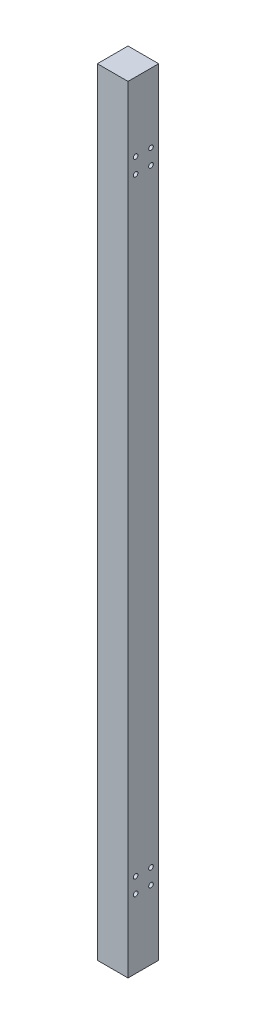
ISO-10303-21;
HEADER;
FILE_DESCRIPTION(('STEP AP214'),'2;1');
FILE_NAME('part.step','',(''),(''),'','','');
FILE_SCHEMA(('AUTOMOTIVE_DESIGN { 1 0 10303 214 1 1 1 1 }'));
ENDSEC;
DATA;
#1=APPLICATION_CONTEXT('core data for automotive mechanical design processes');
#2=APPLICATION_PROTOCOL_DEFINITION('international standard','automotive_design',2000,#1);
#3=PRODUCT_CONTEXT('',#1,'mechanical');
#4=PRODUCT('Part','Part','',(#3));
#5=PRODUCT_RELATED_PRODUCT_CATEGORY('part','',(#4));
#6=PRODUCT_DEFINITION_FORMATION('','',#4);
#7=PRODUCT_DEFINITION_CONTEXT('part definition',#1,'design');
#8=PRODUCT_DEFINITION('design','',#6,#7);
#9=PRODUCT_DEFINITION_SHAPE('','',#8);
#10=(LENGTH_UNIT() NAMED_UNIT(*) SI_UNIT(.MILLI.,.METRE.));
#11=(NAMED_UNIT(*) PLANE_ANGLE_UNIT() SI_UNIT($,.RADIAN.));
#12=(NAMED_UNIT(*) SI_UNIT($,.STERADIAN.) SOLID_ANGLE_UNIT());
#13=UNCERTAINTY_MEASURE_WITH_UNIT(LENGTH_MEASURE(1.E-05),#10,'distance_accuracy_value','');
#14=(GEOMETRIC_REPRESENTATION_CONTEXT(3) GLOBAL_UNCERTAINTY_ASSIGNED_CONTEXT((#13)) GLOBAL_UNIT_ASSIGNED_CONTEXT((#10,
#11,#12)) REPRESENTATION_CONTEXT('',''));
#15=CARTESIAN_POINT('',(0.,0.,0.));
#16=DIRECTION('',(0.,0.,1.));
#17=DIRECTION('',(1.,0.,0.));
#18=AXIS2_PLACEMENT_3D('',#15,#16,#17);
#19=CARTESIAN_POINT('',(-30.,1520.,-30.));
#20=DIRECTION('',(1.,0.,0.));
#21=DIRECTION('',(0.,0.,-1.));
#22=AXIS2_PLACEMENT_3D('',#19,#20,#21);
#23=PLANE('',#22);
#24=CARTESIAN_POINT('',(-30.,165.,15.0000000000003));
#25=DIRECTION('',(-1.,0.,0.));
#26=DIRECTION('',(0.,0.,1.));
#27=AXIS2_PLACEMENT_3D('',#24,#25,#26);
#28=CIRCLE('',#27,9.00000000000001);
#29=CARTESIAN_POINT('',(-30.,165.,24.0000000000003));
#30=VERTEX_POINT('',#29);
#31=EDGE_CURVE('E201',#30,#30,#28,.T.);
#32=ORIENTED_EDGE('',*,*,#31,.F.);
#33=EDGE_LOOP('',(#32));
#34=FACE_BOUND('',#33,.T.);
#35=CARTESIAN_POINT('',(-30.,135.,15.0000000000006));
#36=DIRECTION('',(-1.,0.,0.));
#37=DIRECTION('',(0.,0.,1.));
#38=AXIS2_PLACEMENT_3D('',#35,#36,#37);
#39=CIRCLE('',#38,9.00000000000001);
#40=CARTESIAN_POINT('',(-30.,135.,24.0000000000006));
#41=VERTEX_POINT('',#40);
#42=EDGE_CURVE('E189',#41,#41,#39,.T.);
#43=ORIENTED_EDGE('',*,*,#42,.F.);
#44=EDGE_LOOP('',(#43));
#45=FACE_BOUND('',#44,.T.);
#46=CARTESIAN_POINT('',(-30.,1385.,-15.));
#47=DIRECTION('',(-1.,0.,0.));
#48=DIRECTION('',(0.,0.,1.));
#49=AXIS2_PLACEMENT_3D('',#46,#47,#48);
#50=CIRCLE('',#49,8.9999999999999);
#51=CARTESIAN_POINT('',(-30.,1385.,-6.0000000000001));
#52=VERTEX_POINT('',#51);
#53=EDGE_CURVE('E177',#52,#52,#50,.T.);
#54=ORIENTED_EDGE('',*,*,#53,.F.);
#55=EDGE_LOOP('',(#54));
#56=FACE_BOUND('',#55,.T.);
#57=CARTESIAN_POINT('',(-30.,1385.,15.));
#58=DIRECTION('',(-1.,0.,0.));
#59=DIRECTION('',(0.,0.,1.));
#60=AXIS2_PLACEMENT_3D('',#57,#58,#59);
#61=CIRCLE('',#60,8.9999999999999);
#62=CARTESIAN_POINT('',(-30.,1385.,23.9999999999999));
#63=VERTEX_POINT('',#62);
#64=EDGE_CURVE('E165',#63,#63,#61,.T.);
#65=ORIENTED_EDGE('',*,*,#64,.F.);
#66=EDGE_LOOP('',(#65));
#67=FACE_BOUND('',#66,.T.);
#68=CARTESIAN_POINT('',(-30.,1355.,15.0000000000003));
#69=DIRECTION('',(-1.,0.,0.));
#70=DIRECTION('',(0.,0.,1.));
#71=AXIS2_PLACEMENT_3D('',#68,#69,#70);
#72=CIRCLE('',#71,8.9999999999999);
#73=CARTESIAN_POINT('',(-30.,1355.,24.0000000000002));
#74=VERTEX_POINT('',#73);
#75=EDGE_CURVE('E153',#74,#74,#72,.T.);
#76=ORIENTED_EDGE('',*,*,#75,.F.);
#77=EDGE_LOOP('',(#76));
#78=FACE_BOUND('',#77,.T.);
#79=DIRECTION('',(0.,0.,1.));
#80=VECTOR('',#79,1.);
#81=CARTESIAN_POINT('',(-30.,0.,-30.));
#82=LINE('',#81,#80);
#83=CARTESIAN_POINT('',(-30.,0.,-30.));
#84=VERTEX_POINT('',#83);
#85=CARTESIAN_POINT('',(-30.,0.,30.));
#86=VERTEX_POINT('',#85);
#87=EDGE_CURVE('E89',#84,#86,#82,.T.);
#88=ORIENTED_EDGE('',*,*,#87,.T.);
#89=DIRECTION('',(0.,-1.,0.));
#90=VECTOR('',#89,1.);
#91=CARTESIAN_POINT('',(-30.,1520.,30.));
#92=LINE('',#91,#90);
#93=CARTESIAN_POINT('',(-30.,1520.,30.));
#94=VERTEX_POINT('',#93);
#95=EDGE_CURVE('E112',#94,#86,#92,.T.);
#96=ORIENTED_EDGE('',*,*,#95,.F.);
#97=DIRECTION('',(0.,0.,1.));
#98=VECTOR('',#97,1.);
#99=CARTESIAN_POINT('',(-30.,1520.,-30.));
#100=LINE('',#99,#98);
#101=CARTESIAN_POINT('',(-30.,1520.,-30.));
#102=VERTEX_POINT('',#101);
#103=EDGE_CURVE('E105',#102,#94,#100,.T.);
#104=ORIENTED_EDGE('',*,*,#103,.F.);
#105=DIRECTION('',(0.,-1.,0.));
#106=VECTOR('',#105,1.);
#107=CARTESIAN_POINT('',(-30.,1520.,-30.));
#108=LINE('',#107,#106);
#109=EDGE_CURVE('E64',#102,#84,#108,.T.);
#110=ORIENTED_EDGE('',*,*,#109,.T.);
#111=EDGE_LOOP('',(#88,#96,#104,#110));
#112=FACE_BOUND('',#111,.T.);
#113=CARTESIAN_POINT('',(-30.,1355.,-14.9999999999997));
#114=DIRECTION('',(-1.,0.,0.));
#115=DIRECTION('',(0.,0.,1.));
#116=AXIS2_PLACEMENT_3D('',#113,#114,#115);
#117=CIRCLE('',#116,8.9999999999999);
#118=CARTESIAN_POINT('',(-30.,1355.,-5.99999999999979));
#119=VERTEX_POINT('',#118);
#120=EDGE_CURVE('E141',#119,#119,#117,.T.);
#121=ORIENTED_EDGE('',*,*,#120,.F.);
#122=EDGE_LOOP('',(#121));
#123=FACE_BOUND('',#122,.T.);
#124=CARTESIAN_POINT('',(-30.,165.,-14.9999999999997));
#125=DIRECTION('',(-1.,0.,0.));
#126=DIRECTION('',(0.,0.,1.));
#127=AXIS2_PLACEMENT_3D('',#124,#125,#126);
#128=CIRCLE('',#127,9.00000000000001);
#129=CARTESIAN_POINT('',(-30.,165.,-5.99999999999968));
#130=VERTEX_POINT('',#129);
#131=EDGE_CURVE('E213',#130,#130,#128,.T.);
#132=ORIENTED_EDGE('',*,*,#131,.F.);
#133=EDGE_LOOP('',(#132));
#134=FACE_BOUND('',#133,.T.);
#135=CARTESIAN_POINT('',(-30.,135.,-14.9999999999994));
#136=DIRECTION('',(-1.,0.,0.));
#137=DIRECTION('',(0.,0.,1.));
#138=AXIS2_PLACEMENT_3D('',#135,#136,#137);
#139=CIRCLE('',#138,9.00000000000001);
#140=CARTESIAN_POINT('',(-30.,135.,-5.99999999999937));
#141=VERTEX_POINT('',#140);
#142=EDGE_CURVE('E225',#141,#141,#139,.T.);
#143=ORIENTED_EDGE('',*,*,#142,.F.);
#144=EDGE_LOOP('',(#143));
#145=FACE_BOUND('',#144,.T.);
#146=ADVANCED_FACE('F55',(#34,#45,#56,#67,#78,#112,#123,#134,#145),#23,.F.);
#147=CARTESIAN_POINT('',(30.,1520.,-30.));
#148=DIRECTION('',(-1.,0.,0.));
#149=DIRECTION('',(0.,0.,1.));
#150=AXIS2_PLACEMENT_3D('',#147,#148,#149);
#151=PLANE('',#150);
#152=CARTESIAN_POINT('',(30.,135.,-14.9999999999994));
#153=DIRECTION('',(-1.,0.,0.));
#154=DIRECTION('',(0.,0.,1.));
#155=AXIS2_PLACEMENT_3D('',#152,#153,#154);
#156=CIRCLE('',#155,4.49999999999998);
#157=CARTESIAN_POINT('',(30.,135.,-10.4999999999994));
#158=VERTEX_POINT('',#157);
#159=EDGE_CURVE('E216',#158,#158,#156,.T.);
#160=ORIENTED_EDGE('',*,*,#159,.T.);
#161=EDGE_LOOP('',(#160));
#162=FACE_BOUND('',#161,.T.);
#163=CARTESIAN_POINT('',(30.,165.,-14.9999999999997));
#164=DIRECTION('',(-1.,0.,0.));
#165=DIRECTION('',(0.,0.,1.));
#166=AXIS2_PLACEMENT_3D('',#163,#164,#165);
#167=CIRCLE('',#166,4.49999999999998);
#168=CARTESIAN_POINT('',(30.,165.,-10.4999999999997));
#169=VERTEX_POINT('',#168);
#170=EDGE_CURVE('E204',#169,#169,#167,.T.);
#171=ORIENTED_EDGE('',*,*,#170,.T.);
#172=EDGE_LOOP('',(#171));
#173=FACE_BOUND('',#172,.T.);
#174=CARTESIAN_POINT('',(30.,165.,15.0000000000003));
#175=DIRECTION('',(-1.,0.,0.));
#176=DIRECTION('',(0.,0.,1.));
#177=AXIS2_PLACEMENT_3D('',#174,#175,#176);
#178=CIRCLE('',#177,4.49999999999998);
#179=CARTESIAN_POINT('',(30.,165.,19.5000000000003));
#180=VERTEX_POINT('',#179);
#181=EDGE_CURVE('E192',#180,#180,#178,.T.);
#182=ORIENTED_EDGE('',*,*,#181,.T.);
#183=EDGE_LOOP('',(#182));
#184=FACE_BOUND('',#183,.T.);
#185=CARTESIAN_POINT('',(30.,135.,15.0000000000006));
#186=DIRECTION('',(-1.,0.,0.));
#187=DIRECTION('',(0.,0.,1.));
#188=AXIS2_PLACEMENT_3D('',#185,#186,#187);
#189=CIRCLE('',#188,4.49999999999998);
#190=CARTESIAN_POINT('',(30.,135.,19.5000000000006));
#191=VERTEX_POINT('',#190);
#192=EDGE_CURVE('E180',#191,#191,#189,.T.);
#193=ORIENTED_EDGE('',*,*,#192,.T.);
#194=EDGE_LOOP('',(#193));
#195=FACE_BOUND('',#194,.T.);
#196=CARTESIAN_POINT('',(30.,1385.,-15.));
#197=DIRECTION('',(-1.,0.,0.));
#198=DIRECTION('',(0.,0.,1.));
#199=AXIS2_PLACEMENT_3D('',#196,#197,#198);
#200=CIRCLE('',#199,4.49999999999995);
#201=CARTESIAN_POINT('',(30.,1385.,-10.5000000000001));
#202=VERTEX_POINT('',#201);
#203=EDGE_CURVE('E168',#202,#202,#200,.T.);
#204=ORIENTED_EDGE('',*,*,#203,.T.);
#205=EDGE_LOOP('',(#204));
#206=FACE_BOUND('',#205,.T.);
#207=CARTESIAN_POINT('',(30.,1385.,15.));
#208=DIRECTION('',(-1.,0.,0.));
#209=DIRECTION('',(0.,0.,1.));
#210=AXIS2_PLACEMENT_3D('',#207,#208,#209);
#211=CIRCLE('',#210,4.49999999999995);
#212=CARTESIAN_POINT('',(30.,1385.,19.4999999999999));
#213=VERTEX_POINT('',#212);
#214=EDGE_CURVE('E156',#213,#213,#211,.T.);
#215=ORIENTED_EDGE('',*,*,#214,.T.);
#216=EDGE_LOOP('',(#215));
#217=FACE_BOUND('',#216,.T.);
#218=CARTESIAN_POINT('',(30.,1355.,15.0000000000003));
#219=DIRECTION('',(-1.,0.,0.));
#220=DIRECTION('',(0.,0.,1.));
#221=AXIS2_PLACEMENT_3D('',#218,#219,#220);
#222=CIRCLE('',#221,4.49999999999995);
#223=CARTESIAN_POINT('',(30.,1355.,19.5000000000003));
#224=VERTEX_POINT('',#223);
#225=EDGE_CURVE('E144',#224,#224,#222,.T.);
#226=ORIENTED_EDGE('',*,*,#225,.T.);
#227=EDGE_LOOP('',(#226));
#228=FACE_BOUND('',#227,.T.);
#229=CARTESIAN_POINT('',(30.,1355.,-14.9999999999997));
#230=DIRECTION('',(-1.,0.,0.));
#231=DIRECTION('',(0.,0.,1.));
#232=AXIS2_PLACEMENT_3D('',#229,#230,#231);
#233=CIRCLE('',#232,4.49999999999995);
#234=CARTESIAN_POINT('',(30.,1355.,-10.4999999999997));
#235=VERTEX_POINT('',#234);
#236=EDGE_CURVE('E122',#235,#235,#233,.T.);
#237=ORIENTED_EDGE('',*,*,#236,.T.);
#238=EDGE_LOOP('',(#237));
#239=FACE_BOUND('',#238,.T.);
#240=DIRECTION('',(0.,0.,-1.));
#241=VECTOR('',#240,1.);
#242=CARTESIAN_POINT('',(30.,0.,-30.));
#243=LINE('',#242,#241);
#244=CARTESIAN_POINT('',(30.,0.,30.));
#245=VERTEX_POINT('',#244);
#246=CARTESIAN_POINT('',(30.,0.,-30.));
#247=VERTEX_POINT('',#246);
#248=EDGE_CURVE('E119',#245,#247,#243,.T.);
#249=ORIENTED_EDGE('',*,*,#248,.T.);
#250=DIRECTION('',(0.,-1.,0.));
#251=VECTOR('',#250,1.);
#252=CARTESIAN_POINT('',(30.,1520.,-30.));
#253=LINE('',#252,#251);
#254=CARTESIAN_POINT('',(30.,1520.,-30.));
#255=VERTEX_POINT('',#254);
#256=EDGE_CURVE('E13',#255,#247,#253,.T.);
#257=ORIENTED_EDGE('',*,*,#256,.F.);
#258=DIRECTION('',(0.,0.,-1.));
#259=VECTOR('',#258,1.);
#260=CARTESIAN_POINT('',(30.,1520.,-30.));
#261=LINE('',#260,#259);
#262=CARTESIAN_POINT('',(30.,1520.,30.));
#263=VERTEX_POINT('',#262);
#264=EDGE_CURVE('E107',#263,#255,#261,.T.);
#265=ORIENTED_EDGE('',*,*,#264,.F.);
#266=DIRECTION('',(0.,-1.,0.));
#267=VECTOR('',#266,1.);
#268=CARTESIAN_POINT('',(30.,1520.,30.));
#269=LINE('',#268,#267);
#270=EDGE_CURVE('E115',#263,#245,#269,.T.);
#271=ORIENTED_EDGE('',*,*,#270,.T.);
#272=EDGE_LOOP('',(#249,#257,#265,#271));
#273=FACE_BOUND('',#272,.T.);
#274=ADVANCED_FACE('F57',(#162,#173,#184,#195,#206,#217,#228,#239,#273),#151,.F.);
#275=CARTESIAN_POINT('',(-30.,1520.,-30.));
#276=DIRECTION('',(0.,0.,1.));
#277=DIRECTION('',(1.,0.,0.));
#278=AXIS2_PLACEMENT_3D('',#275,#276,#277);
#279=PLANE('',#278);
#280=DIRECTION('',(-1.,0.,0.));
#281=VECTOR('',#280,1.);
#282=CARTESIAN_POINT('',(-30.,0.,-30.));
#283=LINE('',#282,#281);
#284=EDGE_CURVE('E111',#247,#84,#283,.T.);
#285=ORIENTED_EDGE('',*,*,#284,.T.);
#286=ORIENTED_EDGE('',*,*,#109,.F.);
#287=DIRECTION('',(-1.,0.,0.));
#288=VECTOR('',#287,1.);
#289=CARTESIAN_POINT('',(-30.,1520.,-30.));
#290=LINE('',#289,#288);
#291=EDGE_CURVE('E102',#255,#102,#290,.T.);
#292=ORIENTED_EDGE('',*,*,#291,.F.);
#293=ORIENTED_EDGE('',*,*,#256,.T.);
#294=EDGE_LOOP('',(#285,#286,#292,#293));
#295=FACE_BOUND('',#294,.T.);
#296=ADVANCED_FACE('F110',(#295),#279,.F.);
#297=CARTESIAN_POINT('',(-30.,1520.,30.));
#298=DIRECTION('',(0.,0.,-1.));
#299=DIRECTION('',(-1.,0.,0.));
#300=AXIS2_PLACEMENT_3D('',#297,#298,#299);
#301=PLANE('',#300);
#302=DIRECTION('',(1.,0.,0.));
#303=VECTOR('',#302,1.);
#304=CARTESIAN_POINT('',(-30.,0.,30.));
#305=LINE('',#304,#303);
#306=EDGE_CURVE('E95',#86,#245,#305,.T.);
#307=ORIENTED_EDGE('',*,*,#306,.T.);
#308=ORIENTED_EDGE('',*,*,#270,.F.);
#309=DIRECTION('',(1.,0.,0.));
#310=VECTOR('',#309,1.);
#311=CARTESIAN_POINT('',(-30.,1520.,30.));
#312=LINE('',#311,#310);
#313=EDGE_CURVE('E72',#94,#263,#312,.T.);
#314=ORIENTED_EDGE('',*,*,#313,.F.);
#315=ORIENTED_EDGE('',*,*,#95,.T.);
#316=EDGE_LOOP('',(#307,#308,#314,#315));
#317=FACE_BOUND('',#316,.T.);
#318=ADVANCED_FACE('F127',(#317),#301,.F.);
#319=CARTESIAN_POINT('',(0.,1520.,0.));
#320=DIRECTION('',(0.,1.,0.));
#321=DIRECTION('',(0.,0.,1.));
#322=AXIS2_PLACEMENT_3D('',#319,#320,#321);
#323=PLANE('',#322);
#324=ORIENTED_EDGE('',*,*,#264,.T.);
#325=ORIENTED_EDGE('',*,*,#291,.T.);
#326=ORIENTED_EDGE('',*,*,#103,.T.);
#327=ORIENTED_EDGE('',*,*,#313,.T.);
#328=EDGE_LOOP('',(#324,#325,#326,#327));
#329=FACE_BOUND('',#328,.T.);
#330=ADVANCED_FACE('F103',(#329),#323,.T.);
#331=CARTESIAN_POINT('',(0.,0.,0.));
#332=DIRECTION('',(0.,1.,0.));
#333=DIRECTION('',(0.,0.,1.));
#334=AXIS2_PLACEMENT_3D('',#331,#332,#333);
#335=PLANE('',#334);
#336=ORIENTED_EDGE('',*,*,#248,.F.);
#337=ORIENTED_EDGE('',*,*,#306,.F.);
#338=ORIENTED_EDGE('',*,*,#87,.F.);
#339=ORIENTED_EDGE('',*,*,#284,.F.);
#340=EDGE_LOOP('',(#336,#337,#338,#339));
#341=FACE_BOUND('',#340,.T.);
#342=ADVANCED_FACE('F130',(#341),#335,.F.);
#343=CARTESIAN_POINT('',(-30.,1355.,-14.9999999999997));
#344=DIRECTION('',(-1.,0.,0.));
#345=DIRECTION('',(0.,0.,1.));
#346=AXIS2_PLACEMENT_3D('',#343,#344,#345);
#347=CYLINDRICAL_SURFACE('',#346,4.49999999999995);
#348=ORIENTED_EDGE('',*,*,#236,.F.);
#349=EDGE_LOOP('',(#348));
#350=FACE_BOUND('',#349,.T.);
#351=CARTESIAN_POINT('',(-29.5,1355.,-14.9999999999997));
#352=DIRECTION('',(-1.,0.,0.));
#353=DIRECTION('',(0.,0.,1.));
#354=AXIS2_PLACEMENT_3D('',#351,#352,#353);
#355=CIRCLE('',#354,4.49999999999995);
#356=CARTESIAN_POINT('',(-29.5,1355.,-10.4999999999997));
#357=VERTEX_POINT('',#356);
#358=EDGE_CURVE('E135',#357,#357,#355,.T.);
#359=ORIENTED_EDGE('',*,*,#358,.T.);
#360=EDGE_LOOP('',(#359));
#361=FACE_BOUND('',#360,.T.);
#362=ADVANCED_FACE('F253',(#350,#361),#347,.F.);
#363=CARTESIAN_POINT('',(-29.5,1359.5,-14.9999999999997));
#364=DIRECTION('',(1.,0.,0.));
#365=DIRECTION('',(0.,0.,-1.));
#366=AXIS2_PLACEMENT_3D('',#363,#364,#365);
#367=PLANE('',#366);
#368=ORIENTED_EDGE('',*,*,#358,.F.);
#369=EDGE_LOOP('',(#368));
#370=FACE_BOUND('',#369,.T.);
#371=CARTESIAN_POINT('',(-29.5,1355.,-14.9999999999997));
#372=DIRECTION('',(-1.,0.,0.));
#373=DIRECTION('',(0.,0.,1.));
#374=AXIS2_PLACEMENT_3D('',#371,#372,#373);
#375=CIRCLE('',#374,8.9999999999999);
#376=CARTESIAN_POINT('',(-29.5,1355.,-5.99999999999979));
#377=VERTEX_POINT('',#376);
#378=EDGE_CURVE('E138',#377,#377,#375,.T.);
#379=ORIENTED_EDGE('',*,*,#378,.T.);
#380=EDGE_LOOP('',(#379));
#381=FACE_BOUND('',#380,.T.);
#382=ADVANCED_FACE('F257',(#370,#381),#367,.F.);
#383=CARTESIAN_POINT('',(-30.,1355.,-14.9999999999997));
#384=DIRECTION('',(-1.,0.,0.));
#385=DIRECTION('',(0.,0.,1.));
#386=AXIS2_PLACEMENT_3D('',#383,#384,#385);
#387=CYLINDRICAL_SURFACE('',#386,8.9999999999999);
#388=ORIENTED_EDGE('',*,*,#378,.F.);
#389=EDGE_LOOP('',(#388));
#390=FACE_BOUND('',#389,.T.);
#391=ORIENTED_EDGE('',*,*,#120,.T.);
#392=EDGE_LOOP('',(#391));
#393=FACE_BOUND('',#392,.T.);
#394=ADVANCED_FACE('F261',(#390,#393),#387,.F.);
#395=CARTESIAN_POINT('',(-30.,1355.,15.0000000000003));
#396=DIRECTION('',(-1.,0.,0.));
#397=DIRECTION('',(0.,0.,1.));
#398=AXIS2_PLACEMENT_3D('',#395,#396,#397);
#399=CYLINDRICAL_SURFACE('',#398,4.49999999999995);
#400=ORIENTED_EDGE('',*,*,#225,.F.);
#401=EDGE_LOOP('',(#400));
#402=FACE_BOUND('',#401,.T.);
#403=CARTESIAN_POINT('',(-29.5,1355.,15.0000000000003));
#404=DIRECTION('',(-1.,0.,0.));
#405=DIRECTION('',(0.,0.,1.));
#406=AXIS2_PLACEMENT_3D('',#403,#404,#405);
#407=CIRCLE('',#406,4.49999999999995);
#408=CARTESIAN_POINT('',(-29.5,1355.,19.5000000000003));
#409=VERTEX_POINT('',#408);
#410=EDGE_CURVE('E147',#409,#409,#407,.T.);
#411=ORIENTED_EDGE('',*,*,#410,.T.);
#412=EDGE_LOOP('',(#411));
#413=FACE_BOUND('',#412,.T.);
#414=ADVANCED_FACE('F265',(#402,#413),#399,.F.);
#415=CARTESIAN_POINT('',(-29.5,1359.5,15.0000000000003));
#416=DIRECTION('',(1.,0.,0.));
#417=DIRECTION('',(0.,0.,-1.));
#418=AXIS2_PLACEMENT_3D('',#415,#416,#417);
#419=PLANE('',#418);
#420=ORIENTED_EDGE('',*,*,#410,.F.);
#421=EDGE_LOOP('',(#420));
#422=FACE_BOUND('',#421,.T.);
#423=CARTESIAN_POINT('',(-29.5,1355.,15.0000000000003));
#424=DIRECTION('',(-1.,0.,0.));
#425=DIRECTION('',(0.,0.,1.));
#426=AXIS2_PLACEMENT_3D('',#423,#424,#425);
#427=CIRCLE('',#426,8.9999999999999);
#428=CARTESIAN_POINT('',(-29.5,1355.,24.0000000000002));
#429=VERTEX_POINT('',#428);
#430=EDGE_CURVE('E150',#429,#429,#427,.T.);
#431=ORIENTED_EDGE('',*,*,#430,.T.);
#432=EDGE_LOOP('',(#431));
#433=FACE_BOUND('',#432,.T.);
#434=ADVANCED_FACE('F269',(#422,#433),#419,.F.);
#435=CARTESIAN_POINT('',(-30.,1355.,15.0000000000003));
#436=DIRECTION('',(-1.,0.,0.));
#437=DIRECTION('',(0.,0.,1.));
#438=AXIS2_PLACEMENT_3D('',#435,#436,#437);
#439=CYLINDRICAL_SURFACE('',#438,8.9999999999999);
#440=ORIENTED_EDGE('',*,*,#430,.F.);
#441=EDGE_LOOP('',(#440));
#442=FACE_BOUND('',#441,.T.);
#443=ORIENTED_EDGE('',*,*,#75,.T.);
#444=EDGE_LOOP('',(#443));
#445=FACE_BOUND('',#444,.T.);
#446=ADVANCED_FACE('F273',(#442,#445),#439,.F.);
#447=CARTESIAN_POINT('',(-30.,1385.,15.));
#448=DIRECTION('',(-1.,0.,0.));
#449=DIRECTION('',(0.,0.,1.));
#450=AXIS2_PLACEMENT_3D('',#447,#448,#449);
#451=CYLINDRICAL_SURFACE('',#450,4.49999999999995);
#452=ORIENTED_EDGE('',*,*,#214,.F.);
#453=EDGE_LOOP('',(#452));
#454=FACE_BOUND('',#453,.T.);
#455=CARTESIAN_POINT('',(-29.5,1385.,15.));
#456=DIRECTION('',(-1.,0.,0.));
#457=DIRECTION('',(0.,0.,1.));
#458=AXIS2_PLACEMENT_3D('',#455,#456,#457);
#459=CIRCLE('',#458,4.49999999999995);
#460=CARTESIAN_POINT('',(-29.5,1385.,19.4999999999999));
#461=VERTEX_POINT('',#460);
#462=EDGE_CURVE('E159',#461,#461,#459,.T.);
#463=ORIENTED_EDGE('',*,*,#462,.T.);
#464=EDGE_LOOP('',(#463));
#465=FACE_BOUND('',#464,.T.);
#466=ADVANCED_FACE('F277',(#454,#465),#451,.F.);
#467=CARTESIAN_POINT('',(-29.5,1389.5,15.));
#468=DIRECTION('',(1.,0.,0.));
#469=DIRECTION('',(0.,0.,-1.));
#470=AXIS2_PLACEMENT_3D('',#467,#468,#469);
#471=PLANE('',#470);
#472=ORIENTED_EDGE('',*,*,#462,.F.);
#473=EDGE_LOOP('',(#472));
#474=FACE_BOUND('',#473,.T.);
#475=CARTESIAN_POINT('',(-29.5,1385.,15.));
#476=DIRECTION('',(-1.,0.,0.));
#477=DIRECTION('',(0.,0.,1.));
#478=AXIS2_PLACEMENT_3D('',#475,#476,#477);
#479=CIRCLE('',#478,8.9999999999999);
#480=CARTESIAN_POINT('',(-29.5,1385.,23.9999999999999));
#481=VERTEX_POINT('',#480);
#482=EDGE_CURVE('E162',#481,#481,#479,.T.);
#483=ORIENTED_EDGE('',*,*,#482,.T.);
#484=EDGE_LOOP('',(#483));
#485=FACE_BOUND('',#484,.T.);
#486=ADVANCED_FACE('F281',(#474,#485),#471,.F.);
#487=CARTESIAN_POINT('',(-30.,1385.,15.));
#488=DIRECTION('',(-1.,0.,0.));
#489=DIRECTION('',(0.,0.,1.));
#490=AXIS2_PLACEMENT_3D('',#487,#488,#489);
#491=CYLINDRICAL_SURFACE('',#490,8.9999999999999);
#492=ORIENTED_EDGE('',*,*,#482,.F.);
#493=EDGE_LOOP('',(#492));
#494=FACE_BOUND('',#493,.T.);
#495=ORIENTED_EDGE('',*,*,#64,.T.);
#496=EDGE_LOOP('',(#495));
#497=FACE_BOUND('',#496,.T.);
#498=ADVANCED_FACE('F285',(#494,#497),#491,.F.);
#499=CARTESIAN_POINT('',(-30.,1385.,-15.));
#500=DIRECTION('',(-1.,0.,0.));
#501=DIRECTION('',(0.,0.,1.));
#502=AXIS2_PLACEMENT_3D('',#499,#500,#501);
#503=CYLINDRICAL_SURFACE('',#502,4.49999999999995);
#504=ORIENTED_EDGE('',*,*,#203,.F.);
#505=EDGE_LOOP('',(#504));
#506=FACE_BOUND('',#505,.T.);
#507=CARTESIAN_POINT('',(-29.5,1385.,-15.));
#508=DIRECTION('',(-1.,0.,0.));
#509=DIRECTION('',(0.,0.,1.));
#510=AXIS2_PLACEMENT_3D('',#507,#508,#509);
#511=CIRCLE('',#510,4.49999999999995);
#512=CARTESIAN_POINT('',(-29.5,1385.,-10.5000000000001));
#513=VERTEX_POINT('',#512);
#514=EDGE_CURVE('E171',#513,#513,#511,.T.);
#515=ORIENTED_EDGE('',*,*,#514,.T.);
#516=EDGE_LOOP('',(#515));
#517=FACE_BOUND('',#516,.T.);
#518=ADVANCED_FACE('F289',(#506,#517),#503,.F.);
#519=CARTESIAN_POINT('',(-29.5,1389.5,-15.));
#520=DIRECTION('',(1.,0.,0.));
#521=DIRECTION('',(0.,0.,-1.));
#522=AXIS2_PLACEMENT_3D('',#519,#520,#521);
#523=PLANE('',#522);
#524=ORIENTED_EDGE('',*,*,#514,.F.);
#525=EDGE_LOOP('',(#524));
#526=FACE_BOUND('',#525,.T.);
#527=CARTESIAN_POINT('',(-29.5,1385.,-15.));
#528=DIRECTION('',(-1.,0.,0.));
#529=DIRECTION('',(0.,0.,1.));
#530=AXIS2_PLACEMENT_3D('',#527,#528,#529);
#531=CIRCLE('',#530,8.9999999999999);
#532=CARTESIAN_POINT('',(-29.5,1385.,-6.0000000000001));
#533=VERTEX_POINT('',#532);
#534=EDGE_CURVE('E174',#533,#533,#531,.T.);
#535=ORIENTED_EDGE('',*,*,#534,.T.);
#536=EDGE_LOOP('',(#535));
#537=FACE_BOUND('',#536,.T.);
#538=ADVANCED_FACE('F293',(#526,#537),#523,.F.);
#539=CARTESIAN_POINT('',(-30.,1385.,-15.));
#540=DIRECTION('',(-1.,0.,0.));
#541=DIRECTION('',(0.,0.,1.));
#542=AXIS2_PLACEMENT_3D('',#539,#540,#541);
#543=CYLINDRICAL_SURFACE('',#542,8.9999999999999);
#544=ORIENTED_EDGE('',*,*,#534,.F.);
#545=EDGE_LOOP('',(#544));
#546=FACE_BOUND('',#545,.T.);
#547=ORIENTED_EDGE('',*,*,#53,.T.);
#548=EDGE_LOOP('',(#547));
#549=FACE_BOUND('',#548,.T.);
#550=ADVANCED_FACE('F297',(#546,#549),#543,.F.);
#551=CARTESIAN_POINT('',(-30.,135.,15.0000000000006));
#552=DIRECTION('',(-1.,0.,0.));
#553=DIRECTION('',(0.,0.,1.));
#554=AXIS2_PLACEMENT_3D('',#551,#552,#553);
#555=CYLINDRICAL_SURFACE('',#554,4.49999999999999);
#556=ORIENTED_EDGE('',*,*,#192,.F.);
#557=EDGE_LOOP('',(#556));
#558=FACE_BOUND('',#557,.T.);
#559=CARTESIAN_POINT('',(-29.5,135.,15.0000000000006));
#560=DIRECTION('',(-1.,0.,0.));
#561=DIRECTION('',(0.,0.,1.));
#562=AXIS2_PLACEMENT_3D('',#559,#560,#561);
#563=CIRCLE('',#562,4.5);
#564=CARTESIAN_POINT('',(-29.5,135.,19.5000000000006));
#565=VERTEX_POINT('',#564);
#566=EDGE_CURVE('E183',#565,#565,#563,.T.);
#567=ORIENTED_EDGE('',*,*,#566,.T.);
#568=EDGE_LOOP('',(#567));
#569=FACE_BOUND('',#568,.T.);
#570=ADVANCED_FACE('F301',(#558,#569),#555,.F.);
#571=CARTESIAN_POINT('',(-29.5,139.5,15.0000000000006));
#572=DIRECTION('',(1.,0.,0.));
#573=DIRECTION('',(0.,0.,-1.));
#574=AXIS2_PLACEMENT_3D('',#571,#572,#573);
#575=PLANE('',#574);
#576=ORIENTED_EDGE('',*,*,#566,.F.);
#577=EDGE_LOOP('',(#576));
#578=FACE_BOUND('',#577,.T.);
#579=CARTESIAN_POINT('',(-29.5,135.,15.0000000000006));
#580=DIRECTION('',(-1.,0.,0.));
#581=DIRECTION('',(0.,0.,1.));
#582=AXIS2_PLACEMENT_3D('',#579,#580,#581);
#583=CIRCLE('',#582,9.00000000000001);
#584=CARTESIAN_POINT('',(-29.5,135.,24.0000000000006));
#585=VERTEX_POINT('',#584);
#586=EDGE_CURVE('E186',#585,#585,#583,.T.);
#587=ORIENTED_EDGE('',*,*,#586,.T.);
#588=EDGE_LOOP('',(#587));
#589=FACE_BOUND('',#588,.T.);
#590=ADVANCED_FACE('F305',(#578,#589),#575,.F.);
#591=CARTESIAN_POINT('',(-30.,135.,15.0000000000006));
#592=DIRECTION('',(-1.,0.,0.));
#593=DIRECTION('',(0.,0.,1.));
#594=AXIS2_PLACEMENT_3D('',#591,#592,#593);
#595=CYLINDRICAL_SURFACE('',#594,9.00000000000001);
#596=ORIENTED_EDGE('',*,*,#586,.F.);
#597=EDGE_LOOP('',(#596));
#598=FACE_BOUND('',#597,.T.);
#599=ORIENTED_EDGE('',*,*,#42,.T.);
#600=EDGE_LOOP('',(#599));
#601=FACE_BOUND('',#600,.T.);
#602=ADVANCED_FACE('F309',(#598,#601),#595,.F.);
#603=CARTESIAN_POINT('',(-30.,165.,15.0000000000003));
#604=DIRECTION('',(-1.,0.,0.));
#605=DIRECTION('',(0.,0.,1.));
#606=AXIS2_PLACEMENT_3D('',#603,#604,#605);
#607=CYLINDRICAL_SURFACE('',#606,4.49999999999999);
#608=ORIENTED_EDGE('',*,*,#181,.F.);
#609=EDGE_LOOP('',(#608));
#610=FACE_BOUND('',#609,.T.);
#611=CARTESIAN_POINT('',(-29.5,165.,15.0000000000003));
#612=DIRECTION('',(-1.,0.,0.));
#613=DIRECTION('',(0.,0.,1.));
#614=AXIS2_PLACEMENT_3D('',#611,#612,#613);
#615=CIRCLE('',#614,4.5);
#616=CARTESIAN_POINT('',(-29.5,165.,19.5000000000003));
#617=VERTEX_POINT('',#616);
#618=EDGE_CURVE('E195',#617,#617,#615,.T.);
#619=ORIENTED_EDGE('',*,*,#618,.T.);
#620=EDGE_LOOP('',(#619));
#621=FACE_BOUND('',#620,.T.);
#622=ADVANCED_FACE('F313',(#610,#621),#607,.F.);
#623=CARTESIAN_POINT('',(-29.5,169.5,15.0000000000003));
#624=DIRECTION('',(1.,0.,0.));
#625=DIRECTION('',(0.,0.,-1.));
#626=AXIS2_PLACEMENT_3D('',#623,#624,#625);
#627=PLANE('',#626);
#628=ORIENTED_EDGE('',*,*,#618,.F.);
#629=EDGE_LOOP('',(#628));
#630=FACE_BOUND('',#629,.T.);
#631=CARTESIAN_POINT('',(-29.5,165.,15.0000000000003));
#632=DIRECTION('',(-1.,0.,0.));
#633=DIRECTION('',(0.,0.,1.));
#634=AXIS2_PLACEMENT_3D('',#631,#632,#633);
#635=CIRCLE('',#634,9.00000000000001);
#636=CARTESIAN_POINT('',(-29.5,165.,24.0000000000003));
#637=VERTEX_POINT('',#636);
#638=EDGE_CURVE('E198',#637,#637,#635,.T.);
#639=ORIENTED_EDGE('',*,*,#638,.T.);
#640=EDGE_LOOP('',(#639));
#641=FACE_BOUND('',#640,.T.);
#642=ADVANCED_FACE('F317',(#630,#641),#627,.F.);
#643=CARTESIAN_POINT('',(-30.,165.,15.0000000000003));
#644=DIRECTION('',(-1.,0.,0.));
#645=DIRECTION('',(0.,0.,1.));
#646=AXIS2_PLACEMENT_3D('',#643,#644,#645);
#647=CYLINDRICAL_SURFACE('',#646,9.00000000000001);
#648=ORIENTED_EDGE('',*,*,#638,.F.);
#649=EDGE_LOOP('',(#648));
#650=FACE_BOUND('',#649,.T.);
#651=ORIENTED_EDGE('',*,*,#31,.T.);
#652=EDGE_LOOP('',(#651));
#653=FACE_BOUND('',#652,.T.);
#654=ADVANCED_FACE('F321',(#650,#653),#647,.F.);
#655=CARTESIAN_POINT('',(-30.,165.,-14.9999999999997));
#656=DIRECTION('',(-1.,0.,0.));
#657=DIRECTION('',(0.,0.,1.));
#658=AXIS2_PLACEMENT_3D('',#655,#656,#657);
#659=CYLINDRICAL_SURFACE('',#658,4.49999999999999);
#660=ORIENTED_EDGE('',*,*,#170,.F.);
#661=EDGE_LOOP('',(#660));
#662=FACE_BOUND('',#661,.T.);
#663=CARTESIAN_POINT('',(-29.5,165.,-14.9999999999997));
#664=DIRECTION('',(-1.,0.,0.));
#665=DIRECTION('',(0.,0.,1.));
#666=AXIS2_PLACEMENT_3D('',#663,#664,#665);
#667=CIRCLE('',#666,4.5);
#668=CARTESIAN_POINT('',(-29.5,165.,-10.4999999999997));
#669=VERTEX_POINT('',#668);
#670=EDGE_CURVE('E207',#669,#669,#667,.T.);
#671=ORIENTED_EDGE('',*,*,#670,.T.);
#672=EDGE_LOOP('',(#671));
#673=FACE_BOUND('',#672,.T.);
#674=ADVANCED_FACE('F325',(#662,#673),#659,.F.);
#675=CARTESIAN_POINT('',(-29.5,169.5,-14.9999999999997));
#676=DIRECTION('',(1.,0.,0.));
#677=DIRECTION('',(0.,0.,-1.));
#678=AXIS2_PLACEMENT_3D('',#675,#676,#677);
#679=PLANE('',#678);
#680=ORIENTED_EDGE('',*,*,#670,.F.);
#681=EDGE_LOOP('',(#680));
#682=FACE_BOUND('',#681,.T.);
#683=CARTESIAN_POINT('',(-29.5,165.,-14.9999999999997));
#684=DIRECTION('',(-1.,0.,0.));
#685=DIRECTION('',(0.,0.,1.));
#686=AXIS2_PLACEMENT_3D('',#683,#684,#685);
#687=CIRCLE('',#686,9.00000000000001);
#688=CARTESIAN_POINT('',(-29.5,165.,-5.99999999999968));
#689=VERTEX_POINT('',#688);
#690=EDGE_CURVE('E210',#689,#689,#687,.T.);
#691=ORIENTED_EDGE('',*,*,#690,.T.);
#692=EDGE_LOOP('',(#691));
#693=FACE_BOUND('',#692,.T.);
#694=ADVANCED_FACE('F329',(#682,#693),#679,.F.);
#695=CARTESIAN_POINT('',(-30.,165.,-14.9999999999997));
#696=DIRECTION('',(-1.,0.,0.));
#697=DIRECTION('',(0.,0.,1.));
#698=AXIS2_PLACEMENT_3D('',#695,#696,#697);
#699=CYLINDRICAL_SURFACE('',#698,9.00000000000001);
#700=ORIENTED_EDGE('',*,*,#690,.F.);
#701=EDGE_LOOP('',(#700));
#702=FACE_BOUND('',#701,.T.);
#703=ORIENTED_EDGE('',*,*,#131,.T.);
#704=EDGE_LOOP('',(#703));
#705=FACE_BOUND('',#704,.T.);
#706=ADVANCED_FACE('F333',(#702,#705),#699,.F.);
#707=CARTESIAN_POINT('',(-30.,135.,-14.9999999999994));
#708=DIRECTION('',(-1.,0.,0.));
#709=DIRECTION('',(0.,0.,1.));
#710=AXIS2_PLACEMENT_3D('',#707,#708,#709);
#711=CYLINDRICAL_SURFACE('',#710,4.49999999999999);
#712=ORIENTED_EDGE('',*,*,#159,.F.);
#713=EDGE_LOOP('',(#712));
#714=FACE_BOUND('',#713,.T.);
#715=CARTESIAN_POINT('',(-29.5,135.,-14.9999999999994));
#716=DIRECTION('',(-1.,0.,0.));
#717=DIRECTION('',(0.,0.,1.));
#718=AXIS2_PLACEMENT_3D('',#715,#716,#717);
#719=CIRCLE('',#718,4.5);
#720=CARTESIAN_POINT('',(-29.5,135.,-10.4999999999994));
#721=VERTEX_POINT('',#720);
#722=EDGE_CURVE('E219',#721,#721,#719,.T.);
#723=ORIENTED_EDGE('',*,*,#722,.T.);
#724=EDGE_LOOP('',(#723));
#725=FACE_BOUND('',#724,.T.);
#726=ADVANCED_FACE('F337',(#714,#725),#711,.F.);
#727=CARTESIAN_POINT('',(-29.5,139.5,-14.9999999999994));
#728=DIRECTION('',(1.,0.,0.));
#729=DIRECTION('',(0.,0.,-1.));
#730=AXIS2_PLACEMENT_3D('',#727,#728,#729);
#731=PLANE('',#730);
#732=ORIENTED_EDGE('',*,*,#722,.F.);
#733=EDGE_LOOP('',(#732));
#734=FACE_BOUND('',#733,.T.);
#735=CARTESIAN_POINT('',(-29.5,135.,-14.9999999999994));
#736=DIRECTION('',(-1.,0.,0.));
#737=DIRECTION('',(0.,0.,1.));
#738=AXIS2_PLACEMENT_3D('',#735,#736,#737);
#739=CIRCLE('',#738,9.00000000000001);
#740=CARTESIAN_POINT('',(-29.5,135.,-5.99999999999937));
#741=VERTEX_POINT('',#740);
#742=EDGE_CURVE('E222',#741,#741,#739,.T.);
#743=ORIENTED_EDGE('',*,*,#742,.T.);
#744=EDGE_LOOP('',(#743));
#745=FACE_BOUND('',#744,.T.);
#746=ADVANCED_FACE('F341',(#734,#745),#731,.F.);
#747=CARTESIAN_POINT('',(-30.,135.,-14.9999999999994));
#748=DIRECTION('',(-1.,0.,0.));
#749=DIRECTION('',(0.,0.,1.));
#750=AXIS2_PLACEMENT_3D('',#747,#748,#749);
#751=CYLINDRICAL_SURFACE('',#750,9.00000000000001);
#752=ORIENTED_EDGE('',*,*,#742,.F.);
#753=EDGE_LOOP('',(#752));
#754=FACE_BOUND('',#753,.T.);
#755=ORIENTED_EDGE('',*,*,#142,.T.);
#756=EDGE_LOOP('',(#755));
#757=FACE_BOUND('',#756,.T.);
#758=ADVANCED_FACE('F229',(#754,#757),#751,.F.);
#759=CLOSED_SHELL('',(#146,#274,#296,#318,#330,#342,#362,#382,#394,#414,#434,#446,#466,#486,
#498,#518,#538,#550,#570,#590,#602,#622,#642,#654,#674,#694,#706,#726,#746,#758));
#760=MANIFOLD_SOLID_BREP('B2',#759);
#761=ADVANCED_BREP_SHAPE_REPRESENTATION('',(#18,#760),#14);
#762=SHAPE_DEFINITION_REPRESENTATION(#9,#761);
ENDSEC;
END-ISO-10303-21;
